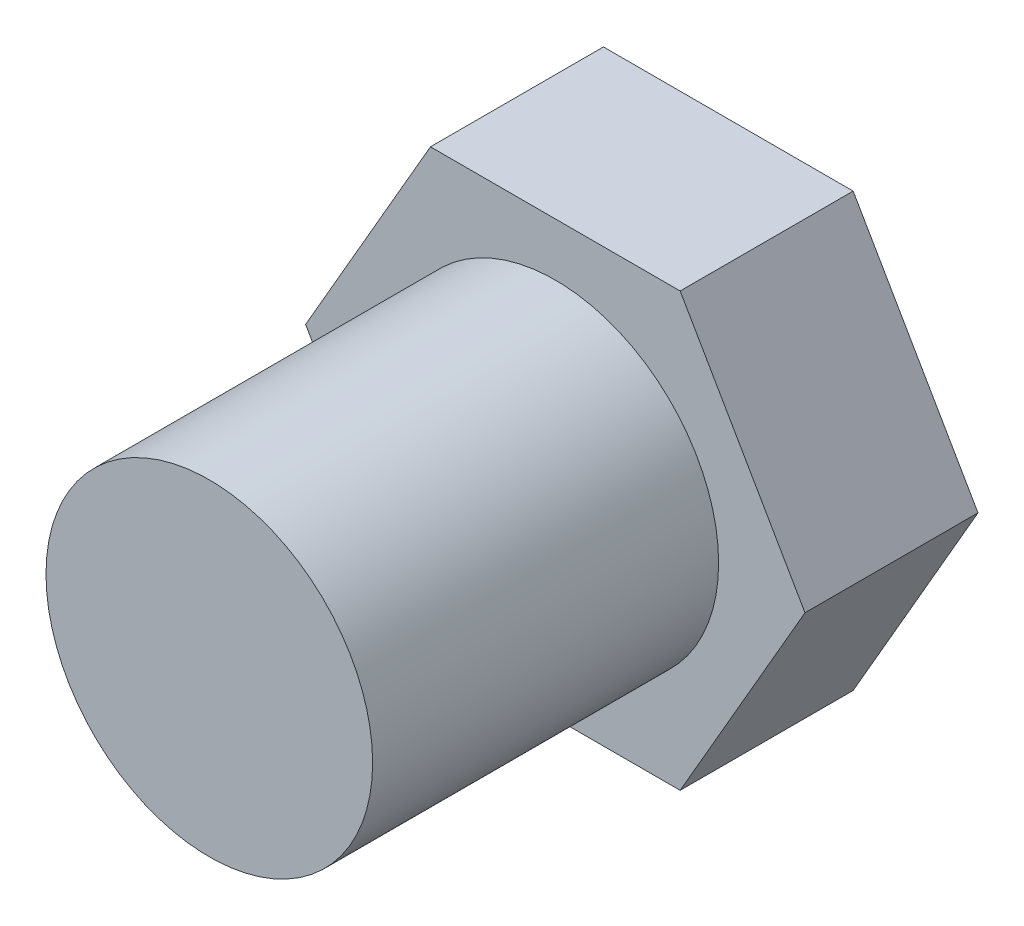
from build123d import *

# Parameters (mm, degrees)
SKETCH1_R           = 5.9944
BOSS_EXTRUDE1_DEPTH = 12.7
BOSS_EXTRUDE2_DEPTH = 6.35


with BuildPart() as part:
    # Sketch1 → Boss-Extrude1 (new body)
    with BuildSketch(Plane.XY):
        Circle(SKETCH1_R)
    extrude(amount=BOSS_EXTRUDE1_DEPTH)

    # Sketch2 → Boss-Extrude2 (add)
    with BuildSketch(Plane(origin=(0, 0, 0), x_dir=(-1, 0, 0), z_dir=(0, 0, -1))):
        Polygon((9.165435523, 0), (4.582717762, 7.9375), (-4.582717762, 7.9375), (-9.165435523, 0), (-4.582717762, -7.9375), (4.582717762, -7.9375), align=None)
    extrude(amount=BOSS_EXTRUDE2_DEPTH)


solid = part.part
